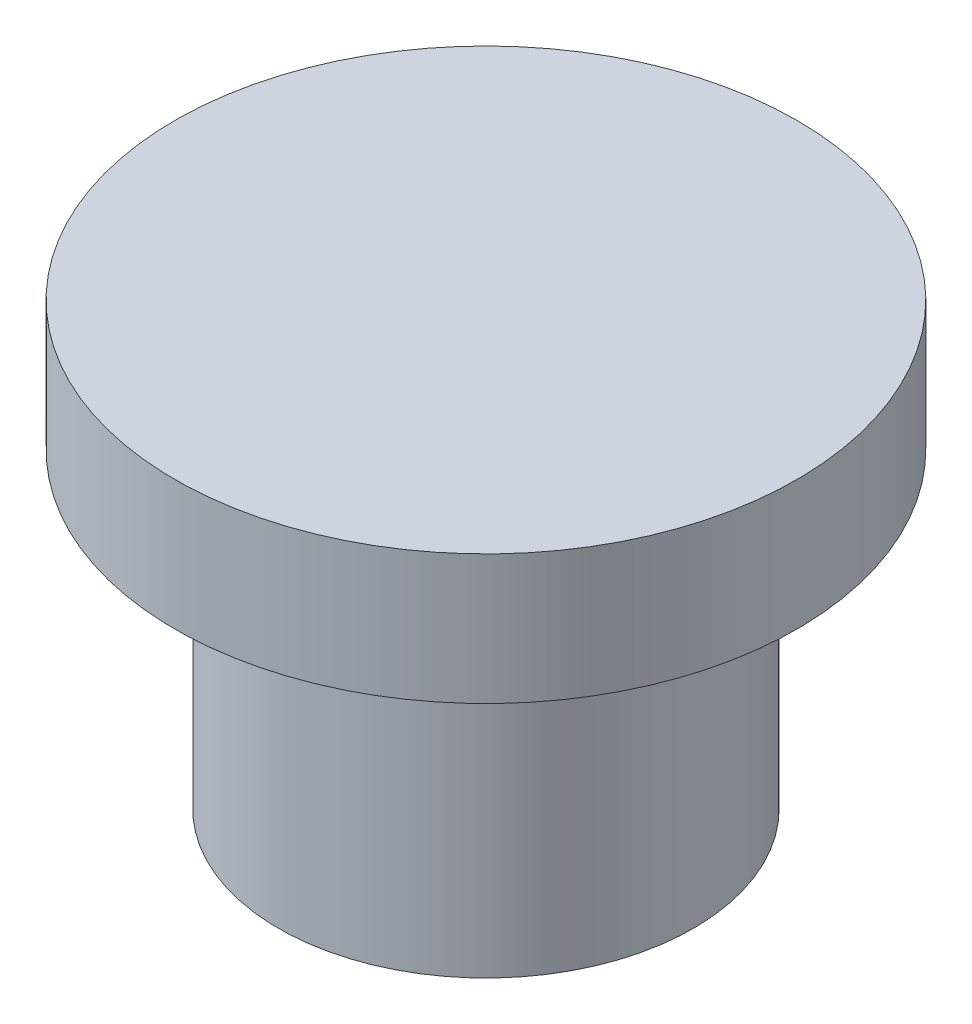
from build123d import *


with BuildPart() as part:
    # Sketch1 → Revolve1 (revolve)
    with BuildSketch(Plane.XY, mode=Mode.PRIVATE) as revolve1_sk:
        Polygon((0, 3.4), (2.4, 3.4), (2.4, 2.4), (1.6, 2.4), (1.6, 0), (0, 0), align=None)
    revolve(revolve1_sk.sketch.rotate(Axis((0, 0, 0), (0, 1, 0)), 90), axis=Axis((0, 0, 0), (0, 1, 0)))


solid = part.part
